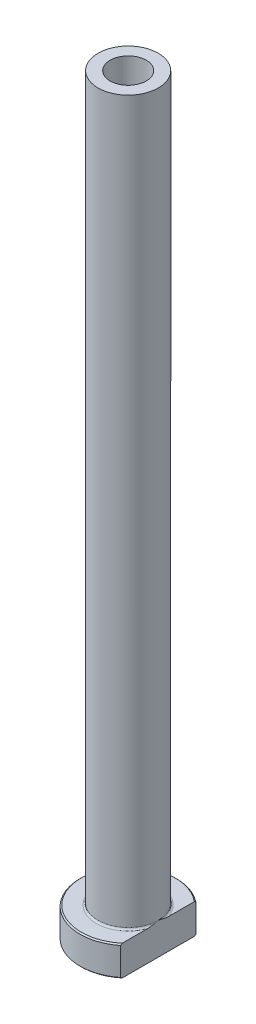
from build123d import *

# Parameters (mm, degrees)
FILLET1_R          = 0.3
CHAMFER1_SIZE      = 0.2
CUT_EXTRUDE1_DEPTH = 126.510955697
CHAMFER2_SIZE      = 0.5


with BuildPart() as part:
    # Sketch1 → Revolve1 (revolve)
    with BuildSketch(Plane.XY, mode=Mode.PRIVATE) as revolve1_sk:
        Polygon((-3, 125), (-5, 125), (-5, 5), (-8, 5), (-8, 0), (-3.25, 0), (-3.25, 68), (-3, 80), align=None)
    revolve(revolve1_sk.sketch.rotate(Axis((0, 92.187680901, 0), (0, -1, 0)), 270), axis=Axis((0, 92.187680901, 0), (0, -1, 0)))

    # Fillet1
    fillet1_edges = [part.edges().sort_by_distance(p)[0] for p in [
        (0, 5, -5),
    ]]
    fillet(fillet1_edges, radius=FILLET1_R)

    # Chamfer1
    chamfer1_edges = [part.edges().sort_by_distance(p)[0] for p in [
        (0, 0, -8),
        (0, 5, -8),
    ]]
    chamfer(chamfer1_edges, length=CHAMFER1_SIZE)

    # Sketch2 → Cut-Extrude1 (cut, through all)
    with BuildSketch(Plane.XZ):
        with BuildLine():
            Line((5, 6.244997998), (5, -6.244997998))
            ThreePointArc((5, -6.244997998), (8, 0), (5, 6.244997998))
        make_face()
    extrude(amount=-CUT_EXTRUDE1_DEPTH, mode=Mode.SUBTRACT)

    # Chamfer2
    chamfer2_edges = [part.edges().sort_by_distance(p)[0] for p in [
        (0, 0, -3.25),
    ]]
    chamfer(chamfer2_edges, length=CHAMFER2_SIZE)


solid = part.part
